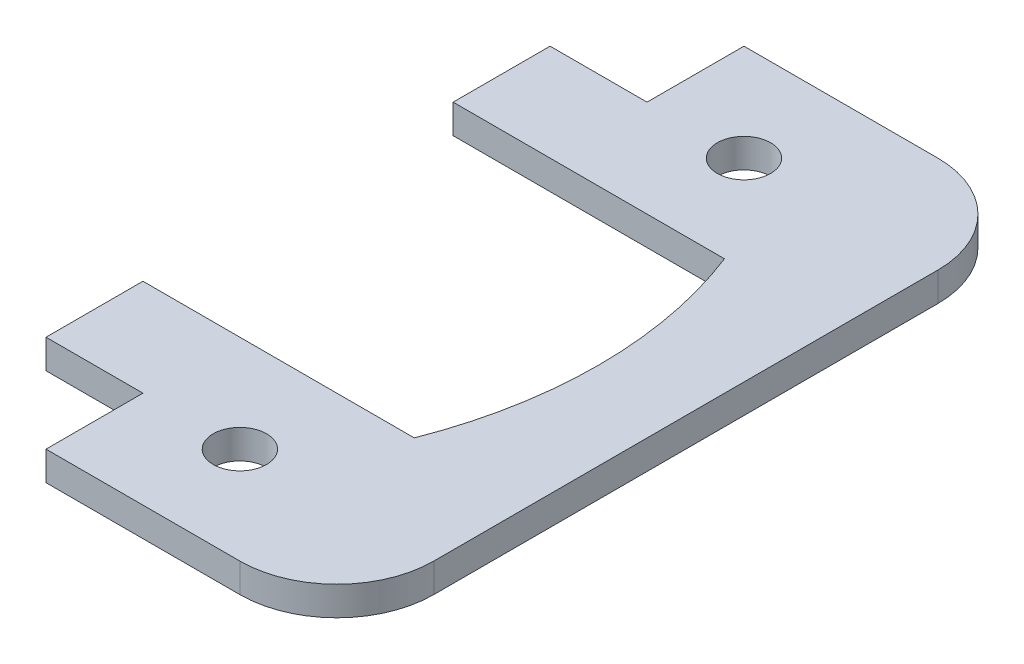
from build123d import *

# Parameters (mm, degrees)
SKETCH1_R      = 2.75
EXTRUDE1_DEPTH = 3


with BuildPart() as part:
    # Sketch1 → Extrude1 (new body)
    with BuildSketch(Plane(origin=(0, 0, 0), x_dir=(1, 0, 0), z_dir=(0, 1, 0))):
        with BuildLine():
            Line((13, -16), (40.987803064, -16))
            ThreePointArc((40.987803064, -16), (44, 0), (40.987803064, 16))
            Line((40.987803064, 16), (13, 16))
            Line((13, 16), (13, 26))
            Line((13, 26), (23, 26))
            Line((23, 26), (23, 36))
            Line((23, 36), (43, 36))
            ThreePointArc((43, 36), (50.071067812, 33.071067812), (53, 26))
            Line((53, 26), (53, -26))
            ThreePointArc((53, -26), (50.071067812, -33.071067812), (43, -36))
            Line((43, -36), (23, -36))
            Line((23, -36), (23, -26))
            Line((23, -26), (13, -26))
            Line((13, -26), (13, -16))
        make_face()
        with Locations(Location((33, 26, 0), (0, 0, 270))):
            Circle(SKETCH1_R, mode=Mode.SUBTRACT)
        with Locations(Location((33, -26, 0), (0, 0, 270))):
            Circle(SKETCH1_R, mode=Mode.SUBTRACT)
    extrude(amount=EXTRUDE1_DEPTH)


solid = part.part
